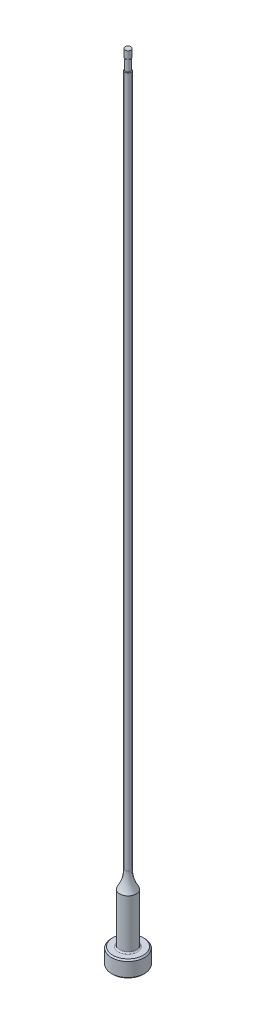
ISO-10303-21;
HEADER;
FILE_DESCRIPTION(('STEP AP214'),'2;1');
FILE_NAME('part.step','',(''),(''),'','','');
FILE_SCHEMA(('AUTOMOTIVE_DESIGN { 1 0 10303 214 1 1 1 1 }'));
ENDSEC;
DATA;
#1=APPLICATION_CONTEXT('core data for automotive mechanical design processes');
#2=APPLICATION_PROTOCOL_DEFINITION('international standard','automotive_design',2000,#1);
#3=PRODUCT_CONTEXT('',#1,'mechanical');
#4=PRODUCT('Part','Part','',(#3));
#5=PRODUCT_RELATED_PRODUCT_CATEGORY('part','',(#4));
#6=PRODUCT_DEFINITION_FORMATION('','',#4);
#7=PRODUCT_DEFINITION_CONTEXT('part definition',#1,'design');
#8=PRODUCT_DEFINITION('design','',#6,#7);
#9=PRODUCT_DEFINITION_SHAPE('','',#8);
#10=(LENGTH_UNIT() NAMED_UNIT(*) SI_UNIT(.MILLI.,.METRE.));
#11=(NAMED_UNIT(*) PLANE_ANGLE_UNIT() SI_UNIT($,.RADIAN.));
#12=(NAMED_UNIT(*) SI_UNIT($,.STERADIAN.) SOLID_ANGLE_UNIT());
#13=UNCERTAINTY_MEASURE_WITH_UNIT(LENGTH_MEASURE(1.E-05),#10,'distance_accuracy_value','');
#14=(GEOMETRIC_REPRESENTATION_CONTEXT(3) GLOBAL_UNCERTAINTY_ASSIGNED_CONTEXT((#13)) GLOBAL_UNIT_ASSIGNED_CONTEXT((#10,
#11,#12)) REPRESENTATION_CONTEXT('',''));
#15=CARTESIAN_POINT('',(0.,0.,0.));
#16=DIRECTION('',(0.,0.,1.));
#17=DIRECTION('',(1.,0.,0.));
#18=AXIS2_PLACEMENT_3D('',#15,#16,#17);
#19=CARTESIAN_POINT('',(0.,259.958771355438,0.));
#20=DIRECTION('',(0.,1.,0.));
#21=DIRECTION('',(0.,0.,1.));
#22=AXIS2_PLACEMENT_3D('',#19,#20,#21);
#23=CYLINDRICAL_SURFACE('',#22,0.594359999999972);
#24=DIRECTION('',(0.,1.,0.));
#25=VECTOR('',#24,1.);
#26=CARTESIAN_POINT('',(-0.492759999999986,259.958771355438,-0.332342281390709));
#27=LINE('',#26,#25);
#28=CARTESIAN_POINT('',(-0.492759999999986,148.719565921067,-0.332342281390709));
#29=VERTEX_POINT('',#28);
#30=CARTESIAN_POINT('',(-0.492759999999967,111.76,-0.332342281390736));
#31=VERTEX_POINT('',#30);
#32=EDGE_CURVE('E66',#29,#31,#27,.F.);
#33=ORIENTED_EDGE('',*,*,#32,.F.);
#34=CARTESIAN_POINT('',(0.,148.719565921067,0.));
#35=DIRECTION('',(0.,1.,0.));
#36=DIRECTION('',(0.,0.,1.));
#37=AXIS2_PLACEMENT_3D('',#34,#35,#36);
#38=CIRCLE('',#37,0.594359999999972);
#39=CARTESIAN_POINT('',(-0.492759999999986,148.719565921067,0.332342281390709));
#40=VERTEX_POINT('',#39);
#41=EDGE_CURVE('E44',#29,#40,#38,.F.);
#42=ORIENTED_EDGE('',*,*,#41,.T.);
#43=DIRECTION('',(0.,1.,0.));
#44=VECTOR('',#43,1.);
#45=CARTESIAN_POINT('',(-0.492759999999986,259.958771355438,0.332342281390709));
#46=LINE('',#45,#44);
#47=CARTESIAN_POINT('',(-0.492759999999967,111.76,0.332342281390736));
#48=VERTEX_POINT('',#47);
#49=EDGE_CURVE('E72',#48,#40,#46,.T.);
#50=ORIENTED_EDGE('',*,*,#49,.F.);
#51=CARTESIAN_POINT('',(-0.492759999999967,111.76,-0.332342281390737));
#52=CARTESIAN_POINT('',(-0.492756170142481,111.721819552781,-0.332315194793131));
#53=CARTESIAN_POINT('',(-0.493448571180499,111.683629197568,-0.331319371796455));
#54=CARTESIAN_POINT('',(-0.496205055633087,111.607285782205,-0.32719484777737));
#55=CARTESIAN_POINT('',(-0.498273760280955,111.569133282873,-0.324058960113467));
#56=CARTESIAN_POINT('',(-0.503877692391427,111.491578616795,-0.315274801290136));
#57=CARTESIAN_POINT('',(-0.507471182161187,111.45219174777,-0.309525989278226));
#58=CARTESIAN_POINT('',(-0.516046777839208,111.374172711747,-0.295012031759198));
#59=CARTESIAN_POINT('',(-0.521026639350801,111.335539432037,-0.286251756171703));
#60=CARTESIAN_POINT('',(-0.532127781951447,111.26013215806,-0.265038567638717));
#61=CARTESIAN_POINT('',(-0.538229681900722,111.223338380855,-0.252646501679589));
#62=CARTESIAN_POINT('',(-0.551257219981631,111.152296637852,-0.222825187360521));
#63=CARTESIAN_POINT('',(-0.55817243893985,111.118024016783,-0.205456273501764));
#64=CARTESIAN_POINT('',(-0.567358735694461,111.075706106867,-0.177255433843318));
#65=CARTESIAN_POINT('',(-0.569648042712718,111.065427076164,-0.169801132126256));
#66=CARTESIAN_POINT('',(-0.574154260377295,111.045625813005,-0.15388318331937));
#67=CARTESIAN_POINT('',(-0.576371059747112,111.03610471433,-0.14541806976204));
#68=CARTESIAN_POINT('',(-0.580650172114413,111.01806685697,-0.127266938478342));
#69=CARTESIAN_POINT('',(-0.582710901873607,111.009559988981,-0.1175705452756));
#70=CARTESIAN_POINT('',(-0.586499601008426,110.994152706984,-0.0969103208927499));
#71=CARTESIAN_POINT('',(-0.588228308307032,110.987248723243,-0.0859493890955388));
#72=CARTESIAN_POINT('',(-0.590708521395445,110.977442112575,-0.0662855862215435));
#73=CARTESIAN_POINT('',(-0.591597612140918,110.97396041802,-0.0578911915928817));
#74=CARTESIAN_POINT('',(-0.593032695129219,110.968365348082,-0.040629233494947));
#75=CARTESIAN_POINT('',(-0.593579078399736,110.966250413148,-0.0317622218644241));
#76=CARTESIAN_POINT('',(-0.594270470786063,110.963577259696,-0.0137206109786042));
#77=CARTESIAN_POINT('',(-0.594413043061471,110.963028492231,-0.00454448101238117));
#78=CARTESIAN_POINT('',(-0.59427126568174,110.963575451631,0.0137560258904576));
#79=CARTESIAN_POINT('',(-0.593986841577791,110.964671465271,0.022880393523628));
#80=CARTESIAN_POINT('',(-0.593063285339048,110.968250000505,0.0401088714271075));
#81=CARTESIAN_POINT('',(-0.592452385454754,110.970622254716,0.048238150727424));
#82=CARTESIAN_POINT('',(-0.590952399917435,110.976489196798,0.0640487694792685));
#83=CARTESIAN_POINT('',(-0.590063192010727,110.979984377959,0.0717299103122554));
#84=CARTESIAN_POINT('',(-0.587497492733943,110.990163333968,0.0908266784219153));
#85=CARTESIAN_POINT('',(-0.585661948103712,110.997526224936,0.101857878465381));
#86=CARTESIAN_POINT('',(-0.581672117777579,111.013837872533,0.122611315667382));
#87=CARTESIAN_POINT('',(-0.579516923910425,111.02279116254,0.132329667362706));
#88=CARTESIAN_POINT('',(-0.573410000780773,111.048730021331,0.157262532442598));
#89=CARTESIAN_POINT('',(-0.569297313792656,111.066800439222,0.171297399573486));
#90=CARTESIAN_POINT('',(-0.561050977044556,111.104739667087,0.196626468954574));
#91=CARTESIAN_POINT('',(-0.55691730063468,111.124613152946,0.20791324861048));
#92=CARTESIAN_POINT('',(-0.548723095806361,111.166118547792,0.22868113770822));
#93=CARTESIAN_POINT('',(-0.544669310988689,111.18778661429,0.238091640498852));
#94=CARTESIAN_POINT('',(-0.536909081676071,111.231888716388,0.255105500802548));
#95=CARTESIAN_POINT('',(-0.533203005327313,111.25432353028,0.262706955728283));
#96=CARTESIAN_POINT('',(-0.522705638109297,111.322539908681,0.283349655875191));
#97=CARTESIAN_POINT('',(-0.516562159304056,111.369099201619,0.29416845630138));
#98=CARTESIAN_POINT('',(-0.508338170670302,111.444558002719,0.308040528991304));
#99=CARTESIAN_POINT('',(-0.505611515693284,111.47316408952,0.312472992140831));
#100=CARTESIAN_POINT('',(-0.50092453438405,111.530636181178,0.319935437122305));
#101=CARTESIAN_POINT('',(-0.498964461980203,111.559502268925,0.32296495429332));
#102=CARTESIAN_POINT('',(-0.495855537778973,111.616951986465,0.327718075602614));
#103=CARTESIAN_POINT('',(-0.494695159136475,111.645533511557,0.329460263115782));
#104=CARTESIAN_POINT('',(-0.493147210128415,111.702743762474,0.331767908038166));
#105=CARTESIAN_POINT('',(-0.492759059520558,111.731372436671,0.332334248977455));
#106=CARTESIAN_POINT('',(-0.492759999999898,111.759999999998,0.332342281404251));
#107=B_SPLINE_CURVE_WITH_KNOTS('',3,(#51,#52,#53,#54,#55,#56,#57,#58,#59,#60,#61,#62,#63,#64,
#65,#66,#67,#68,#69,#70,#71,#72,#73,#74,#75,#76,#77,#78,#79,#80,#81,#82,#83,#84,#85,#86,#87,#88,
#89,#90,#91,#92,#93,#94,#95,#96,#97,#98,#99,#100,#101,#102,#103,#104,#105,#106),.UNSPECIFIED.,
.F.,.F.,(4,2,2,2,2,2,2,2,2,2,2,2,2,2,2,2,2,2,2,2,2,2,2,2,2,2,2,4),(0.,0.114538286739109,
0.229463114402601,0.349243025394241,0.468830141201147,0.586518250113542,0.702835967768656,
0.741495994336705,0.780212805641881,0.819280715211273,0.85826076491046,0.885552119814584,
0.912812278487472,0.940236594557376,0.967665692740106,0.993035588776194,1.01841664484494,
1.05835278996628,1.09840465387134,1.16775387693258,1.23728838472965,1.30908278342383,
1.38095235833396,1.52513678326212,1.61233352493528,1.69955912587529,1.78549956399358,
1.87137540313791),.UNSPECIFIED.);
#108=EDGE_CURVE('E74',#31,#48,#107,.T.);
#109=ORIENTED_EDGE('',*,*,#108,.F.);
#110=EDGE_LOOP('',(#33,#42,#50,#109));
#111=FACE_BOUND('',#110,.T.);
#112=CARTESIAN_POINT('',(0.,16.1097728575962,0.));
#113=DIRECTION('',(0.,1.,0.));
#114=DIRECTION('',(0.,0.,1.));
#115=AXIS2_PLACEMENT_3D('',#112,#113,#114);
#116=CIRCLE('',#115,0.594359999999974);
#117=CARTESIAN_POINT('',(0.,16.1097728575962,0.594359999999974));
#118=VERTEX_POINT('',#117);
#119=EDGE_CURVE('E95',#118,#118,#116,.T.);
#120=ORIENTED_EDGE('',*,*,#119,.T.);
#121=EDGE_LOOP('',(#120));
#122=FACE_BOUND('',#121,.T.);
#123=ADVANCED_FACE('F36',(#111,#122),#23,.T.);
#124=CARTESIAN_POINT('',(0.,16.1097728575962,0.));
#125=DIRECTION('',(0.,1.,0.));
#126=DIRECTION('',(0.,0.,1.));
#127=AXIS2_PLACEMENT_3D('',#124,#125,#126);
#128=TOROIDAL_SURFACE('',#127,6.94435999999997,6.35);
#129=CARTESIAN_POINT('',(0.,12.7,0.));
#130=DIRECTION('',(0.,1.,0.));
#131=DIRECTION('',(0.,0.,1.));
#132=AXIS2_PLACEMENT_3D('',#129,#130,#131);
#133=CIRCLE('',#132,1.58749999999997);
#134=CARTESIAN_POINT('',(0.,12.7,1.58749999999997));
#135=VERTEX_POINT('',#134);
#136=EDGE_CURVE('E92',#135,#135,#133,.T.);
#137=ORIENTED_EDGE('',*,*,#136,.T.);
#138=EDGE_LOOP('',(#137));
#139=FACE_BOUND('',#138,.T.);
#140=ORIENTED_EDGE('',*,*,#119,.F.);
#141=EDGE_LOOP('',(#140));
#142=FACE_BOUND('',#141,.T.);
#143=ADVANCED_FACE('F156',(#139,#142),#128,.F.);
#144=CARTESIAN_POINT('',(0.,259.958771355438,0.));
#145=DIRECTION('',(0.,1.,0.));
#146=DIRECTION('',(0.,0.,1.));
#147=AXIS2_PLACEMENT_3D('',#144,#145,#146);
#148=CYLINDRICAL_SURFACE('',#147,1.58749999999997);
#149=CARTESIAN_POINT('',(0.,3.42900000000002,0.));
#150=DIRECTION('',(0.,1.,0.));
#151=DIRECTION('',(0.,0.,1.));
#152=AXIS2_PLACEMENT_3D('',#149,#150,#151);
#153=CIRCLE('',#152,1.58749999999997);
#154=CARTESIAN_POINT('',(0.,3.42900000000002,1.58749999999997));
#155=VERTEX_POINT('',#154);
#156=EDGE_CURVE('E110',#155,#155,#153,.T.);
#157=ORIENTED_EDGE('',*,*,#156,.T.);
#158=EDGE_LOOP('',(#157));
#159=FACE_BOUND('',#158,.T.);
#160=ORIENTED_EDGE('',*,*,#136,.F.);
#161=EDGE_LOOP('',(#160));
#162=FACE_BOUND('',#161,.T.);
#163=ADVANCED_FACE('F153',(#159,#162),#148,.T.);
#164=CARTESIAN_POINT('',(-3.17499999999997,3.175,0.));
#165=DIRECTION('',(0.,1.,0.));
#166=DIRECTION('',(0.,0.,1.));
#167=AXIS2_PLACEMENT_3D('',#164,#165,#166);
#168=PLANE('',#167);
#169=CARTESIAN_POINT('',(0.,3.175,0.));
#170=DIRECTION('',(0.,1.,0.));
#171=DIRECTION('',(0.,0.,1.));
#172=AXIS2_PLACEMENT_3D('',#169,#170,#171);
#173=CIRCLE('',#172,1.84149999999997);
#174=CARTESIAN_POINT('',(0.,3.175,1.84149999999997));
#175=VERTEX_POINT('',#174);
#176=EDGE_CURVE('E78',#175,#175,#173,.F.);
#177=ORIENTED_EDGE('',*,*,#176,.T.);
#178=EDGE_LOOP('',(#177));
#179=FACE_BOUND('',#178,.T.);
#180=CARTESIAN_POINT('',(0.,3.175,0.));
#181=DIRECTION('',(0.,1.,0.));
#182=DIRECTION('',(0.,0.,1.));
#183=AXIS2_PLACEMENT_3D('',#180,#181,#182);
#184=CIRCLE('',#183,2.92099999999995);
#185=CARTESIAN_POINT('',(0.,3.175,2.92099999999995));
#186=VERTEX_POINT('',#185);
#187=EDGE_CURVE('E98',#186,#186,#184,.T.);
#188=ORIENTED_EDGE('',*,*,#187,.T.);
#189=EDGE_LOOP('',(#188));
#190=FACE_BOUND('',#189,.T.);
#191=ADVANCED_FACE('F149',(#179,#190),#168,.T.);
#192=CARTESIAN_POINT('',(0.,259.958771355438,0.));
#193=DIRECTION('',(0.,1.,0.));
#194=DIRECTION('',(0.,0.,1.));
#195=AXIS2_PLACEMENT_3D('',#192,#193,#194);
#196=CYLINDRICAL_SURFACE('',#195,3.17499999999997);
#197=CARTESIAN_POINT('',(0.,2.92100000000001,0.));
#198=DIRECTION('',(0.,1.,0.));
#199=DIRECTION('',(0.,0.,1.));
#200=AXIS2_PLACEMENT_3D('',#197,#198,#199);
#201=CIRCLE('',#200,3.17499999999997);
#202=CARTESIAN_POINT('',(0.,2.92100000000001,3.17499999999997));
#203=VERTEX_POINT('',#202);
#204=EDGE_CURVE('E104',#203,#203,#201,.F.);
#205=ORIENTED_EDGE('',*,*,#204,.T.);
#206=EDGE_LOOP('',(#205));
#207=FACE_BOUND('',#206,.T.);
#208=CARTESIAN_POINT('',(0.,0.254000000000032,0.));
#209=DIRECTION('',(0.,-1.,0.));
#210=DIRECTION('',(0.,0.,-1.));
#211=AXIS2_PLACEMENT_3D('',#208,#209,#210);
#212=CIRCLE('',#211,3.17499999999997);
#213=CARTESIAN_POINT('',(0.,0.254000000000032,-3.17499999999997));
#214=VERTEX_POINT('',#213);
#215=EDGE_CURVE('E101',#214,#214,#212,.F.);
#216=ORIENTED_EDGE('',*,*,#215,.T.);
#217=EDGE_LOOP('',(#216));
#218=FACE_BOUND('',#217,.T.);
#219=ADVANCED_FACE('F145',(#207,#218),#196,.T.);
#220=CARTESIAN_POINT('',(0.,0.,0.));
#221=DIRECTION('',(0.,-1.,0.));
#222=DIRECTION('',(0.,0.,-1.));
#223=AXIS2_PLACEMENT_3D('',#220,#221,#222);
#224=PLANE('',#223);
#225=CARTESIAN_POINT('',(0.,0.,0.));
#226=DIRECTION('',(0.,-1.,0.));
#227=DIRECTION('',(0.,0.,-1.));
#228=AXIS2_PLACEMENT_3D('',#225,#226,#227);
#229=CIRCLE('',#228,2.92099999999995);
#230=CARTESIAN_POINT('',(0.,0.,-2.92099999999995));
#231=VERTEX_POINT('',#230);
#232=EDGE_CURVE('E107',#231,#231,#229,.T.);
#233=ORIENTED_EDGE('',*,*,#232,.T.);
#234=EDGE_LOOP('',(#233));
#235=FACE_BOUND('',#234,.T.);
#236=ADVANCED_FACE('F141',(#235),#224,.T.);
#237=CARTESIAN_POINT('',(0.,3.17499999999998,0.));
#238=DIRECTION('',(0.,-1.,0.));
#239=DIRECTION('',(0.,0.,-1.));
#240=AXIS2_PLACEMENT_3D('',#237,#238,#239);
#241=CONICAL_SURFACE('',#240,2.92099999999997,0.7853981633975);
#242=ORIENTED_EDGE('',*,*,#204,.F.);
#243=EDGE_LOOP('',(#242));
#244=FACE_BOUND('',#243,.T.);
#245=ORIENTED_EDGE('',*,*,#187,.F.);
#246=EDGE_LOOP('',(#245));
#247=FACE_BOUND('',#246,.T.);
#248=ADVANCED_FACE('F144',(#244,#247),#241,.T.);
#249=CARTESIAN_POINT('',(0.,0.254000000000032,0.));
#250=DIRECTION('',(0.,1.,0.));
#251=DIRECTION('',(0.,0.,1.));
#252=AXIS2_PLACEMENT_3D('',#249,#250,#251);
#253=CONICAL_SURFACE('',#252,3.17499999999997,0.785398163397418);
#254=ORIENTED_EDGE('',*,*,#232,.F.);
#255=EDGE_LOOP('',(#254));
#256=FACE_BOUND('',#255,.T.);
#257=ORIENTED_EDGE('',*,*,#215,.F.);
#258=EDGE_LOOP('',(#257));
#259=FACE_BOUND('',#258,.T.);
#260=ADVANCED_FACE('F245',(#256,#259),#253,.T.);
#261=CARTESIAN_POINT('',(0.,3.42900000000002,0.));
#262=DIRECTION('',(0.,1.,0.));
#263=DIRECTION('',(0.,0.,1.));
#264=AXIS2_PLACEMENT_3D('',#261,#262,#263);
#265=TOROIDAL_SURFACE('',#264,1.84149999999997,0.254);
#266=ORIENTED_EDGE('',*,*,#176,.F.);
#267=EDGE_LOOP('',(#266));
#268=FACE_BOUND('',#267,.T.);
#269=ORIENTED_EDGE('',*,*,#156,.F.);
#270=EDGE_LOOP('',(#269));
#271=FACE_BOUND('',#270,.T.);
#272=ADVANCED_FACE('F139',(#268,#271),#265,.F.);
#273=CARTESIAN_POINT('',(0.,153.448281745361,0.));
#274=DIRECTION('',(0.,1.,0.));
#275=DIRECTION('',(0.,0.,1.));
#276=AXIS2_PLACEMENT_3D('',#273,#274,#275);
#277=CYLINDRICAL_SURFACE('',#276,0.492759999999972);
#278=CARTESIAN_POINT('',(0.,150.876,0.));
#279=DIRECTION('',(0.,1.,0.));
#280=DIRECTION('',(0.,0.,1.));
#281=AXIS2_PLACEMENT_3D('',#278,#279,#280);
#282=CIRCLE('',#281,0.492759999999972);
#283=CARTESIAN_POINT('',(0.,150.876,0.492759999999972));
#284=VERTEX_POINT('',#283);
#285=EDGE_CURVE('E71',#284,#284,#282,.T.);
#286=ORIENTED_EDGE('',*,*,#285,.F.);
#287=EDGE_LOOP('',(#286));
#288=FACE_BOUND('',#287,.T.);
#289=CARTESIAN_POINT('',(0.,148.844,0.));
#290=DIRECTION('',(0.,1.,0.));
#291=DIRECTION('',(0.,0.,1.));
#292=AXIS2_PLACEMENT_3D('',#289,#290,#291);
#293=CIRCLE('',#292,0.492759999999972);
#294=CARTESIAN_POINT('',(-0.492759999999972,148.844,0.));
#295=VERTEX_POINT('',#294);
#296=EDGE_CURVE('E89',#295,#295,#293,.T.);
#297=ORIENTED_EDGE('',*,*,#296,.T.);
#298=EDGE_LOOP('',(#297));
#299=FACE_BOUND('',#298,.T.);
#300=ADVANCED_FACE('F136',(#288,#299),#277,.T.);
#301=CARTESIAN_POINT('',(-0.492759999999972,149.86,-3.17499999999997));
#302=DIRECTION('',(1.,0.,0.));
#303=DIRECTION('',(0.,1.,0.));
#304=AXIS2_PLACEMENT_3D('',#301,#302,#303);
#305=PLANE('',#304);
#306=CARTESIAN_POINT('',(-0.492759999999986,148.719565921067,0.332342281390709));
#307=CARTESIAN_POINT('',(-0.492759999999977,148.72445108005,0.332357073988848));
#308=CARTESIAN_POINT('',(-0.492759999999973,148.729318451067,0.331839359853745));
#309=CARTESIAN_POINT('',(-0.492759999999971,148.738805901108,0.329871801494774));
#310=CARTESIAN_POINT('',(-0.492759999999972,148.743428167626,0.328432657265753));
#311=CARTESIAN_POINT('',(-0.492759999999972,148.752313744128,0.324757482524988));
#312=CARTESIAN_POINT('',(-0.492759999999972,148.756578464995,0.322524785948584));
#313=CARTESIAN_POINT('',(-0.492759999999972,148.764714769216,0.317418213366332));
#314=CARTESIAN_POINT('',(-0.492759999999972,148.768585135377,0.314542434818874));
#315=CARTESIAN_POINT('',(-0.492759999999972,148.777640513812,0.306816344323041));
#316=CARTESIAN_POINT('',(-0.492759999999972,148.782577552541,0.301676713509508));
#317=CARTESIAN_POINT('',(-0.492759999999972,148.791587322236,0.290701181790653));
#318=CARTESIAN_POINT('',(-0.492759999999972,148.795658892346,0.284864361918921));
#319=CARTESIAN_POINT('',(-0.492759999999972,148.805607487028,0.268553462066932));
#320=CARTESIAN_POINT('',(-0.492759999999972,148.810790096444,0.257660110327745));
#321=CARTESIAN_POINT('',(-0.492759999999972,148.819580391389,0.235187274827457));
#322=CARTESIAN_POINT('',(-0.492759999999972,148.823173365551,0.223602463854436));
#323=CARTESIAN_POINT('',(-0.492759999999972,148.830704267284,0.194167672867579));
#324=CARTESIAN_POINT('',(-0.492759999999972,148.833886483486,0.176130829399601));
#325=CARTESIAN_POINT('',(-0.492759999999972,148.838644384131,0.139809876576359));
#326=CARTESIAN_POINT('',(-0.492759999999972,148.840213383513,0.121525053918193));
#327=CARTESIAN_POINT('',(-0.492759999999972,148.842380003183,0.0859638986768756));
#328=CARTESIAN_POINT('',(-0.492759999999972,148.84302849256,0.068690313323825));
#329=CARTESIAN_POINT('',(-0.492759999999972,148.843816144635,0.0342749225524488));
#330=CARTESIAN_POINT('',(-0.492759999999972,148.843959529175,0.0171332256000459));
#331=CARTESIAN_POINT('',(-0.492759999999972,148.844,0.));
#332=B_SPLINE_CURVE_WITH_KNOTS('',3,(#306,#307,#308,#309,#310,#311,#312,#313,#314,#315,#316,
#317,#318,#319,#320,#321,#322,#323,#324,#325,#326,#327,#328,#329,#330,#331),.UNSPECIFIED.,.F.,
.F.,(4,2,2,2,2,2,2,2,2,2,2,2,4),(0.,0.0145999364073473,0.029033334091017,0.0434067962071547,
0.0578233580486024,0.0790827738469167,0.100370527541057,0.136356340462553,0.17266855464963,
0.227468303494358,0.282494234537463,0.334342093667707,0.385755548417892),.UNSPECIFIED.);
#333=EDGE_CURVE('E77',#40,#295,#332,.T.);
#334=ORIENTED_EDGE('',*,*,#333,.T.);
#335=CARTESIAN_POINT('',(-0.492759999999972,148.844,0.));
#336=CARTESIAN_POINT('',(-0.492759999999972,148.843956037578,-0.0174712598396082));
#337=CARTESIAN_POINT('',(-0.492759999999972,148.843808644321,-0.034952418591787));
#338=CARTESIAN_POINT('',(-0.492759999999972,148.842987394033,-0.0700519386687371));
#339=CARTESIAN_POINT('',(-0.492759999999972,148.842308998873,-0.0876701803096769));
#340=CARTESIAN_POINT('',(-0.492759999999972,148.840066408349,-0.123326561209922));
#341=CARTESIAN_POINT('',(-0.492759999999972,148.838479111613,-0.14136339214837));
#342=CARTESIAN_POINT('',(-0.492759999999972,148.833706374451,-0.177190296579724));
#343=CARTESIAN_POINT('',(-0.492759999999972,148.830527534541,-0.194981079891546));
#344=CARTESIAN_POINT('',(-0.492759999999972,148.823991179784,-0.220348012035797));
#345=CARTESIAN_POINT('',(-0.492759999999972,148.821682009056,-0.228189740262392));
#346=CARTESIAN_POINT('',(-0.492759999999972,148.816387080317,-0.243637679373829));
#347=CARTESIAN_POINT('',(-0.492759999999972,148.813402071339,-0.251244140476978));
#348=CARTESIAN_POINT('',(-0.492759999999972,148.806570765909,-0.266152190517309));
#349=CARTESIAN_POINT('',(-0.492759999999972,148.802716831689,-0.273450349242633));
#350=CARTESIAN_POINT('',(-0.492759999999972,148.793983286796,-0.287413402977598));
#351=CARTESIAN_POINT('',(-0.492759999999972,148.789105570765,-0.294079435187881));
#352=CARTESIAN_POINT('',(-0.492759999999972,148.780143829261,-0.304142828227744));
#353=CARTESIAN_POINT('',(-0.492759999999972,148.776410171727,-0.307850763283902));
#354=CARTESIAN_POINT('',(-0.492759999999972,148.768437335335,-0.314683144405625));
#355=CARTESIAN_POINT('',(-0.492759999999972,148.764198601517,-0.317808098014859));
#356=CARTESIAN_POINT('',(-0.492759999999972,148.755908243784,-0.322875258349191));
#357=CARTESIAN_POINT('',(-0.492759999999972,148.751922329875,-0.324924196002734));
#358=CARTESIAN_POINT('',(-0.492759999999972,148.743667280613,-0.328328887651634));
#359=CARTESIAN_POINT('',(-0.492759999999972,148.739398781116,-0.329686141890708));
#360=CARTESIAN_POINT('',(-0.492759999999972,148.732507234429,-0.331205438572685));
#361=CARTESIAN_POINT('',(-0.492759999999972,148.729940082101,-0.33162986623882));
#362=CARTESIAN_POINT('',(-0.492759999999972,148.724771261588,-0.332199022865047));
#363=CARTESIAN_POINT('',(-0.492759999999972,148.722169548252,-0.33234334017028));
#364=CARTESIAN_POINT('',(-0.492759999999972,148.719565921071,-0.332342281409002));
#365=B_SPLINE_CURVE_WITH_KNOTS('',3,(#335,#336,#337,#338,#339,#340,#341,#342,#343,#344,#345,
#346,#347,#348,#349,#350,#351,#352,#353,#354,#355,#356,#357,#358,#359,#360,#361,#362,#363,#364),
.UNSPECIFIED.,.F.,.F.,(4,2,2,2,2,2,2,2,2,2,2,2,2,2,4),(0.,0.0524301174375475,0.10531327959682,
0.159604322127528,0.21367204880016,0.238172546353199,0.262646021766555,0.287343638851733,
0.311995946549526,0.327737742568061,0.343465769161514,0.356857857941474,0.370220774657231,
0.378012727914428,0.385816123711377),.UNSPECIFIED.);
#366=EDGE_CURVE('E58',#295,#29,#365,.T.);
#367=ORIENTED_EDGE('',*,*,#366,.T.);
#368=ORIENTED_EDGE('',*,*,#32,.T.);
#369=DIRECTION('',(0.,0.,1.));
#370=VECTOR('',#369,1.);
#371=CARTESIAN_POINT('',(-0.492759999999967,111.76,-3.17499999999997));
#372=LINE('',#371,#370);
#373=EDGE_CURVE('E70',#31,#48,#372,.T.);
#374=ORIENTED_EDGE('',*,*,#373,.T.);
#375=ORIENTED_EDGE('',*,*,#49,.T.);
#376=EDGE_LOOP('',(#334,#367,#368,#374,#375));
#377=FACE_BOUND('',#376,.T.);
#378=ADVANCED_FACE('F68',(#377),#305,.F.);
#379=CARTESIAN_POINT('',(-3.66775999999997,111.76,-3.17499999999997));
#380=DIRECTION('',(0.,0.,1.));
#381=DIRECTION('',(1.,0.,0.));
#382=AXIS2_PLACEMENT_3D('',#379,#380,#381);
#383=CYLINDRICAL_SURFACE('',#382,3.175);
#384=ORIENTED_EDGE('',*,*,#373,.F.);
#385=ORIENTED_EDGE('',*,*,#108,.T.);
#386=EDGE_LOOP('',(#384,#385));
#387=FACE_BOUND('',#386,.T.);
#388=ADVANCED_FACE('F80',(#387),#383,.F.);
#389=CARTESIAN_POINT('',(0.,152.687735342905,0.));
#390=DIRECTION('',(0.,1.,0.));
#391=DIRECTION('',(0.,0.,1.));
#392=AXIS2_PLACEMENT_3D('',#389,#390,#391);
#393=CYLINDRICAL_SURFACE('',#392,0.568959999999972);
#394=CARTESIAN_POINT('',(0.,150.992397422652,0.));
#395=DIRECTION('',(0.,-1.,0.));
#396=DIRECTION('',(0.,0.,-1.));
#397=AXIS2_PLACEMENT_3D('',#394,#395,#396);
#398=CIRCLE('',#397,0.568959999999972);
#399=CARTESIAN_POINT('',(0.,150.992397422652,-0.568959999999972));
#400=VERTEX_POINT('',#399);
#401=EDGE_CURVE('E11',#400,#400,#398,.F.);
#402=ORIENTED_EDGE('',*,*,#401,.T.);
#403=EDGE_LOOP('',(#402));
#404=FACE_BOUND('',#403,.T.);
#405=CARTESIAN_POINT('',(0.,152.4,0.));
#406=DIRECTION('',(0.,1.,0.));
#407=DIRECTION('',(0.,0.,1.));
#408=AXIS2_PLACEMENT_3D('',#405,#406,#407);
#409=CIRCLE('',#408,0.568959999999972);
#410=CARTESIAN_POINT('',(0.,152.4,0.568959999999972));
#411=VERTEX_POINT('',#410);
#412=EDGE_CURVE('E81',#411,#411,#409,.T.);
#413=ORIENTED_EDGE('',*,*,#412,.F.);
#414=EDGE_LOOP('',(#413));
#415=FACE_BOUND('',#414,.T.);
#416=ADVANCED_FACE('F133',(#404,#415),#393,.T.);
#417=CARTESIAN_POINT('',(-0.59435999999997,152.4,0.));
#418=DIRECTION('',(0.,1.,0.));
#419=DIRECTION('',(0.,0.,1.));
#420=AXIS2_PLACEMENT_3D('',#417,#418,#419);
#421=PLANE('',#420);
#422=ORIENTED_EDGE('',*,*,#412,.T.);
#423=EDGE_LOOP('',(#422));
#424=FACE_BOUND('',#423,.T.);
#425=ADVANCED_FACE('F177',(#424),#421,.T.);
#426=CARTESIAN_POINT('',(0.,148.719565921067,0.));
#427=DIRECTION('',(0.,1.,0.));
#428=DIRECTION('',(0.,0.,1.));
#429=AXIS2_PLACEMENT_3D('',#426,#427,#428);
#430=TOROIDAL_SURFACE('',#429,0.467359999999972,0.127);
#431=ORIENTED_EDGE('',*,*,#333,.F.);
#432=ORIENTED_EDGE('',*,*,#41,.F.);
#433=ORIENTED_EDGE('',*,*,#366,.F.);
#434=ORIENTED_EDGE('',*,*,#296,.F.);
#435=EDGE_LOOP('',(#431,#432,#433,#434));
#436=FACE_BOUND('',#435,.T.);
#437=ADVANCED_FACE('F209',(#436),#430,.T.);
#438=CARTESIAN_POINT('',(0.,150.992397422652,0.));
#439=DIRECTION('',(0.,-1.,0.));
#440=DIRECTION('',(0.,0.,-1.));
#441=AXIS2_PLACEMENT_3D('',#438,#439,#440);
#442=TOROIDAL_SURFACE('',#441,0.441959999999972,0.127);
#443=ORIENTED_EDGE('',*,*,#285,.T.);
#444=EDGE_LOOP('',(#443));
#445=FACE_BOUND('',#444,.T.);
#446=ORIENTED_EDGE('',*,*,#401,.F.);
#447=EDGE_LOOP('',(#446));
#448=FACE_BOUND('',#447,.T.);
#449=ADVANCED_FACE('F38',(#445,#448),#442,.T.);
#450=CLOSED_SHELL('',(#123,#143,#163,#191,#219,#236,#248,#260,#272,#300,#378,#388,#416,#425,
#437,#449));
#451=MANIFOLD_SOLID_BREP('B2',#450);
#452=ADVANCED_BREP_SHAPE_REPRESENTATION('',(#18,#451),#14);
#453=SHAPE_DEFINITION_REPRESENTATION(#9,#452);
ENDSEC;
END-ISO-10303-21;
